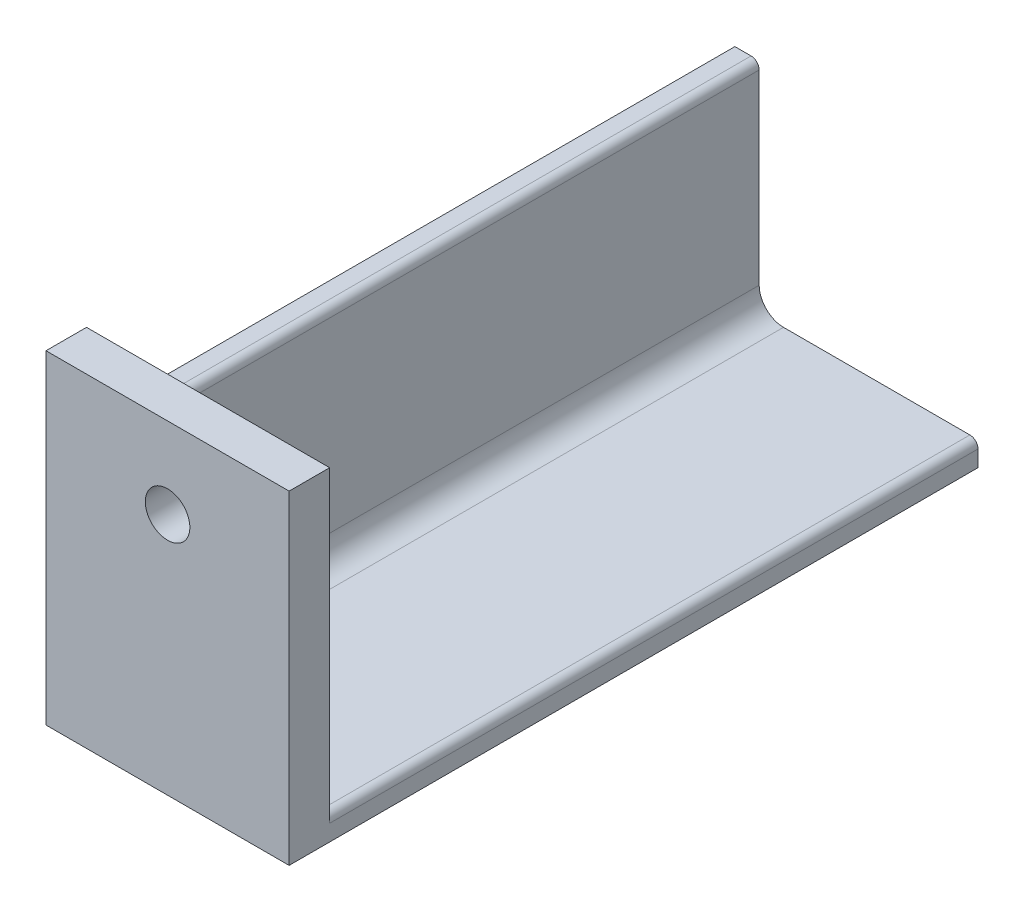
ISO-10303-21;
HEADER;
FILE_DESCRIPTION(('STEP AP214'),'2;1');
FILE_NAME('part.step','',(''),(''),'','','');
FILE_SCHEMA(('AUTOMOTIVE_DESIGN { 1 0 10303 214 1 1 1 1 }'));
ENDSEC;
DATA;
#1=APPLICATION_CONTEXT('core data for automotive mechanical design processes');
#2=APPLICATION_PROTOCOL_DEFINITION('international standard','automotive_design',2000,#1);
#3=PRODUCT_CONTEXT('',#1,'mechanical');
#4=PRODUCT('Part','Part','',(#3));
#5=PRODUCT_RELATED_PRODUCT_CATEGORY('part','',(#4));
#6=PRODUCT_DEFINITION_FORMATION('','',#4);
#7=PRODUCT_DEFINITION_CONTEXT('part definition',#1,'design');
#8=PRODUCT_DEFINITION('design','',#6,#7);
#9=PRODUCT_DEFINITION_SHAPE('','',#8);
#10=(LENGTH_UNIT() NAMED_UNIT(*) SI_UNIT(.MILLI.,.METRE.));
#11=(NAMED_UNIT(*) PLANE_ANGLE_UNIT() SI_UNIT($,.RADIAN.));
#12=(NAMED_UNIT(*) SI_UNIT($,.STERADIAN.) SOLID_ANGLE_UNIT());
#13=UNCERTAINTY_MEASURE_WITH_UNIT(LENGTH_MEASURE(1.E-05),#10,'distance_accuracy_value','');
#14=(GEOMETRIC_REPRESENTATION_CONTEXT(3) GLOBAL_UNCERTAINTY_ASSIGNED_CONTEXT((#13)) GLOBAL_UNIT_ASSIGNED_CONTEXT((#10,
#11,#12)) REPRESENTATION_CONTEXT('',''));
#15=CARTESIAN_POINT('',(0.,0.,0.));
#16=DIRECTION('',(0.,0.,1.));
#17=DIRECTION('',(1.,0.,0.));
#18=AXIS2_PLACEMENT_3D('',#15,#16,#17);
#19=CARTESIAN_POINT('',(4.00000000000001,60.,160.));
#20=DIRECTION('',(0.,-1.,0.));
#21=DIRECTION('',(0.,0.,-1.));
#22=AXIS2_PLACEMENT_3D('',#19,#20,#21);
#23=PLANE('',#22);
#24=DIRECTION('',(-1.,0.,0.));
#25=VECTOR('',#24,1.);
#26=CARTESIAN_POINT('',(4.00000000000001,60.,0.));
#27=LINE('',#26,#25);
#28=CARTESIAN_POINT('',(4.00000000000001,60.,0.));
#29=VERTEX_POINT('',#28);
#30=CARTESIAN_POINT('',(0.,60.,0.));
#31=VERTEX_POINT('',#30);
#32=EDGE_CURVE('E141',#29,#31,#27,.T.);
#33=ORIENTED_EDGE('',*,*,#32,.T.);
#34=DIRECTION('',(0.,0.,-1.));
#35=VECTOR('',#34,1.);
#36=CARTESIAN_POINT('',(0.,60.,160.));
#37=LINE('',#36,#35);
#38=CARTESIAN_POINT('',(0.,60.,160.));
#39=VERTEX_POINT('',#38);
#40=EDGE_CURVE('E11',#39,#31,#37,.T.);
#41=ORIENTED_EDGE('',*,*,#40,.F.);
#42=DIRECTION('',(-1.,0.,0.));
#43=VECTOR('',#42,1.);
#44=CARTESIAN_POINT('',(4.00000000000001,60.,160.));
#45=LINE('',#44,#43);
#46=CARTESIAN_POINT('',(4.00000000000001,60.,160.));
#47=VERTEX_POINT('',#46);
#48=EDGE_CURVE('E133',#47,#39,#45,.T.);
#49=ORIENTED_EDGE('',*,*,#48,.F.);
#50=DIRECTION('',(0.,0.,-1.));
#51=VECTOR('',#50,1.);
#52=CARTESIAN_POINT('',(4.00000000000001,60.,160.));
#53=LINE('',#52,#51);
#54=EDGE_CURVE('E140',#47,#29,#53,.T.);
#55=ORIENTED_EDGE('',*,*,#54,.T.);
#56=EDGE_LOOP('',(#33,#41,#49,#55));
#57=FACE_BOUND('',#56,.T.);
#58=ADVANCED_FACE('F33',(#57),#23,.F.);
#59=CARTESIAN_POINT('',(0.,60.,160.));
#60=DIRECTION('',(1.,0.,0.));
#61=DIRECTION('',(0.,1.,0.));
#62=AXIS2_PLACEMENT_3D('',#59,#60,#61);
#63=PLANE('',#62);
#64=DIRECTION('',(0.,-1.,0.));
#65=VECTOR('',#64,1.);
#66=CARTESIAN_POINT('',(0.,60.,0.));
#67=LINE('',#66,#65);
#68=CARTESIAN_POINT('',(0.,0.,0.));
#69=VERTEX_POINT('',#68);
#70=EDGE_CURVE('E143',#31,#69,#67,.T.);
#71=ORIENTED_EDGE('',*,*,#70,.T.);
#72=DIRECTION('',(0.,0.,-1.));
#73=VECTOR('',#72,1.);
#74=CARTESIAN_POINT('',(0.,0.,160.));
#75=LINE('',#74,#73);
#76=CARTESIAN_POINT('',(0.,0.,170.));
#77=VERTEX_POINT('',#76);
#78=EDGE_CURVE('E41',#77,#69,#75,.T.);
#79=ORIENTED_EDGE('',*,*,#78,.F.);
#80=DIRECTION('',(0.,-1.,0.));
#81=VECTOR('',#80,1.);
#82=CARTESIAN_POINT('',(0.,0.,170.));
#83=LINE('',#82,#81);
#84=CARTESIAN_POINT('',(0.,80.,170.));
#85=VERTEX_POINT('',#84);
#86=EDGE_CURVE('E200',#85,#77,#83,.T.);
#87=ORIENTED_EDGE('',*,*,#86,.F.);
#88=DIRECTION('',(0.,0.,-1.));
#89=VECTOR('',#88,1.);
#90=CARTESIAN_POINT('',(0.,80.,170.));
#91=LINE('',#90,#89);
#92=CARTESIAN_POINT('',(0.,80.,160.));
#93=VERTEX_POINT('',#92);
#94=EDGE_CURVE('E207',#85,#93,#91,.T.);
#95=ORIENTED_EDGE('',*,*,#94,.T.);
#96=DIRECTION('',(0.,-1.,0.));
#97=VECTOR('',#96,1.);
#98=CARTESIAN_POINT('',(0.,0.,160.));
#99=LINE('',#98,#97);
#100=EDGE_CURVE('E198',#93,#39,#99,.T.);
#101=ORIENTED_EDGE('',*,*,#100,.T.);
#102=ORIENTED_EDGE('',*,*,#40,.T.);
#103=EDGE_LOOP('',(#71,#79,#87,#95,#101,#102));
#104=FACE_BOUND('',#103,.T.);
#105=ADVANCED_FACE('F212',(#104),#63,.F.);
#106=CARTESIAN_POINT('',(0.,0.,160.));
#107=DIRECTION('',(0.,1.,0.));
#108=DIRECTION('',(0.,0.,1.));
#109=AXIS2_PLACEMENT_3D('',#106,#107,#108);
#110=PLANE('',#109);
#111=DIRECTION('',(1.,0.,0.));
#112=VECTOR('',#111,1.);
#113=CARTESIAN_POINT('',(0.,0.,0.));
#114=LINE('',#113,#112);
#115=CARTESIAN_POINT('',(60.,0.,0.));
#116=VERTEX_POINT('',#115);
#117=EDGE_CURVE('E146',#69,#116,#114,.T.);
#118=ORIENTED_EDGE('',*,*,#117,.T.);
#119=DIRECTION('',(0.,0.,-1.));
#120=VECTOR('',#119,1.);
#121=CARTESIAN_POINT('',(60.,0.,160.));
#122=LINE('',#121,#120);
#123=CARTESIAN_POINT('',(60.,0.,170.));
#124=VERTEX_POINT('',#123);
#125=EDGE_CURVE('E164',#124,#116,#122,.T.);
#126=ORIENTED_EDGE('',*,*,#125,.F.);
#127=DIRECTION('',(1.,0.,0.));
#128=VECTOR('',#127,1.);
#129=CARTESIAN_POINT('',(0.,0.,170.));
#130=LINE('',#129,#128);
#131=EDGE_CURVE('E175',#77,#124,#130,.T.);
#132=ORIENTED_EDGE('',*,*,#131,.F.);
#133=ORIENTED_EDGE('',*,*,#78,.T.);
#134=EDGE_LOOP('',(#118,#126,#132,#133));
#135=FACE_BOUND('',#134,.T.);
#136=ADVANCED_FACE('F171',(#135),#110,.F.);
#137=CARTESIAN_POINT('',(60.,0.,160.));
#138=DIRECTION('',(-1.,0.,0.));
#139=DIRECTION('',(0.,0.,1.));
#140=AXIS2_PLACEMENT_3D('',#137,#138,#139);
#141=PLANE('',#140);
#142=DIRECTION('',(0.,1.,0.));
#143=VECTOR('',#142,1.);
#144=CARTESIAN_POINT('',(60.,0.,0.));
#145=LINE('',#144,#143);
#146=CARTESIAN_POINT('',(60.,4.,0.));
#147=VERTEX_POINT('',#146);
#148=EDGE_CURVE('E148',#116,#147,#145,.T.);
#149=ORIENTED_EDGE('',*,*,#148,.T.);
#150=DIRECTION('',(0.,0.,-1.));
#151=VECTOR('',#150,1.);
#152=CARTESIAN_POINT('',(60.,4.,160.));
#153=LINE('',#152,#151);
#154=CARTESIAN_POINT('',(60.,4.,160.));
#155=VERTEX_POINT('',#154);
#156=EDGE_CURVE('E161',#155,#147,#153,.T.);
#157=ORIENTED_EDGE('',*,*,#156,.F.);
#158=DIRECTION('',(0.,1.,0.));
#159=VECTOR('',#158,1.);
#160=CARTESIAN_POINT('',(60.,0.,160.));
#161=LINE('',#160,#159);
#162=CARTESIAN_POINT('',(60.,80.,160.));
#163=VERTEX_POINT('',#162);
#164=EDGE_CURVE('E191',#155,#163,#161,.T.);
#165=ORIENTED_EDGE('',*,*,#164,.T.);
#166=DIRECTION('',(0.,0.,-1.));
#167=VECTOR('',#166,1.);
#168=CARTESIAN_POINT('',(60.,80.,170.));
#169=LINE('',#168,#167);
#170=CARTESIAN_POINT('',(60.,80.,170.));
#171=VERTEX_POINT('',#170);
#172=EDGE_CURVE('E144',#171,#163,#169,.T.);
#173=ORIENTED_EDGE('',*,*,#172,.F.);
#174=DIRECTION('',(0.,1.,0.));
#175=VECTOR('',#174,1.);
#176=CARTESIAN_POINT('',(60.,0.,170.));
#177=LINE('',#176,#175);
#178=EDGE_CURVE('E229',#124,#171,#177,.T.);
#179=ORIENTED_EDGE('',*,*,#178,.F.);
#180=ORIENTED_EDGE('',*,*,#125,.T.);
#181=EDGE_LOOP('',(#149,#157,#165,#173,#179,#180));
#182=FACE_BOUND('',#181,.T.);
#183=ADVANCED_FACE('F185',(#182),#141,.F.);
#184=CARTESIAN_POINT('',(58.,4.,160.));
#185=DIRECTION('',(0.,0.,-1.));
#186=DIRECTION('',(-1.,0.,0.));
#187=AXIS2_PLACEMENT_3D('',#184,#185,#186);
#188=CYLINDRICAL_SURFACE('',#187,2.);
#189=CARTESIAN_POINT('',(58.,4.,0.));
#190=DIRECTION('',(0.,0.,1.));
#191=DIRECTION('',(1.,0.,0.));
#192=AXIS2_PLACEMENT_3D('',#189,#190,#191);
#193=CIRCLE('',#192,2.);
#194=CARTESIAN_POINT('',(58.,6.,0.));
#195=VERTEX_POINT('',#194);
#196=EDGE_CURVE('E150',#147,#195,#193,.T.);
#197=ORIENTED_EDGE('',*,*,#196,.T.);
#198=DIRECTION('',(0.,0.,-1.));
#199=VECTOR('',#198,1.);
#200=CARTESIAN_POINT('',(58.,6.,160.));
#201=LINE('',#200,#199);
#202=CARTESIAN_POINT('',(58.,6.,160.));
#203=VERTEX_POINT('',#202);
#204=EDGE_CURVE('E117',#203,#195,#201,.T.);
#205=ORIENTED_EDGE('',*,*,#204,.F.);
#206=CARTESIAN_POINT('',(58.,4.,160.));
#207=DIRECTION('',(0.,0.,1.));
#208=DIRECTION('',(1.,0.,0.));
#209=AXIS2_PLACEMENT_3D('',#206,#207,#208);
#210=CIRCLE('',#209,2.);
#211=EDGE_CURVE('E131',#155,#203,#210,.T.);
#212=ORIENTED_EDGE('',*,*,#211,.F.);
#213=ORIENTED_EDGE('',*,*,#156,.T.);
#214=EDGE_LOOP('',(#197,#205,#212,#213));
#215=FACE_BOUND('',#214,.T.);
#216=ADVANCED_FACE('F189',(#215),#188,.T.);
#217=CARTESIAN_POINT('',(58.,6.,160.));
#218=DIRECTION('',(0.,-1.,0.));
#219=DIRECTION('',(1.,0.,0.));
#220=AXIS2_PLACEMENT_3D('',#217,#218,#219);
#221=PLANE('',#220);
#222=DIRECTION('',(-1.,0.,0.));
#223=VECTOR('',#222,1.);
#224=CARTESIAN_POINT('',(58.,6.,0.));
#225=LINE('',#224,#223);
#226=CARTESIAN_POINT('',(12.,6.,0.));
#227=VERTEX_POINT('',#226);
#228=EDGE_CURVE('E114',#195,#227,#225,.T.);
#229=ORIENTED_EDGE('',*,*,#228,.T.);
#230=DIRECTION('',(0.,0.,-1.));
#231=VECTOR('',#230,1.);
#232=CARTESIAN_POINT('',(12.,6.,160.));
#233=LINE('',#232,#231);
#234=CARTESIAN_POINT('',(12.,6.,160.));
#235=VERTEX_POINT('',#234);
#236=EDGE_CURVE('E106',#235,#227,#233,.T.);
#237=ORIENTED_EDGE('',*,*,#236,.F.);
#238=DIRECTION('',(-1.,0.,0.));
#239=VECTOR('',#238,1.);
#240=CARTESIAN_POINT('',(58.,6.,160.));
#241=LINE('',#240,#239);
#242=EDGE_CURVE('E111',#203,#235,#241,.T.);
#243=ORIENTED_EDGE('',*,*,#242,.F.);
#244=ORIENTED_EDGE('',*,*,#204,.T.);
#245=EDGE_LOOP('',(#229,#237,#243,#244));
#246=FACE_BOUND('',#245,.T.);
#247=ADVANCED_FACE('F108',(#246),#221,.F.);
#248=CARTESIAN_POINT('',(12.,12.,160.));
#249=DIRECTION('',(0.,0.,-1.));
#250=DIRECTION('',(-1.,0.,0.));
#251=AXIS2_PLACEMENT_3D('',#248,#249,#250);
#252=CYLINDRICAL_SURFACE('',#251,6.);
#253=CARTESIAN_POINT('',(12.,12.,0.));
#254=DIRECTION('',(0.,0.,-1.));
#255=DIRECTION('',(-1.,0.,0.));
#256=AXIS2_PLACEMENT_3D('',#253,#254,#255);
#257=CIRCLE('',#256,6.);
#258=CARTESIAN_POINT('',(6.,12.,0.));
#259=VERTEX_POINT('',#258);
#260=EDGE_CURVE('E153',#227,#259,#257,.T.);
#261=ORIENTED_EDGE('',*,*,#260,.T.);
#262=DIRECTION('',(0.,0.,-1.));
#263=VECTOR('',#262,1.);
#264=CARTESIAN_POINT('',(6.,12.,160.));
#265=LINE('',#264,#263);
#266=CARTESIAN_POINT('',(6.,12.,160.));
#267=VERTEX_POINT('',#266);
#268=EDGE_CURVE('E118',#267,#259,#265,.T.);
#269=ORIENTED_EDGE('',*,*,#268,.F.);
#270=CARTESIAN_POINT('',(12.,12.,160.));
#271=DIRECTION('',(0.,0.,-1.));
#272=DIRECTION('',(-1.,0.,0.));
#273=AXIS2_PLACEMENT_3D('',#270,#271,#272);
#274=CIRCLE('',#273,6.);
#275=EDGE_CURVE('E121',#235,#267,#274,.T.);
#276=ORIENTED_EDGE('',*,*,#275,.F.);
#277=ORIENTED_EDGE('',*,*,#236,.T.);
#278=EDGE_LOOP('',(#261,#269,#276,#277));
#279=FACE_BOUND('',#278,.T.);
#280=ADVANCED_FACE('F122',(#279),#252,.F.);
#281=CARTESIAN_POINT('',(6.,12.,160.));
#282=DIRECTION('',(-1.,0.,0.));
#283=DIRECTION('',(0.,-1.,0.));
#284=AXIS2_PLACEMENT_3D('',#281,#282,#283);
#285=PLANE('',#284);
#286=DIRECTION('',(0.,1.,0.));
#287=VECTOR('',#286,1.);
#288=CARTESIAN_POINT('',(6.,12.,0.));
#289=LINE('',#288,#287);
#290=CARTESIAN_POINT('',(6.00000000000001,58.,0.));
#291=VERTEX_POINT('',#290);
#292=EDGE_CURVE('E80',#259,#291,#289,.T.);
#293=ORIENTED_EDGE('',*,*,#292,.T.);
#294=DIRECTION('',(0.,0.,-1.));
#295=VECTOR('',#294,1.);
#296=CARTESIAN_POINT('',(6.00000000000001,58.,160.));
#297=LINE('',#296,#295);
#298=CARTESIAN_POINT('',(6.00000000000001,58.,160.));
#299=VERTEX_POINT('',#298);
#300=EDGE_CURVE('E49',#299,#291,#297,.T.);
#301=ORIENTED_EDGE('',*,*,#300,.F.);
#302=DIRECTION('',(0.,1.,0.));
#303=VECTOR('',#302,1.);
#304=CARTESIAN_POINT('',(6.,12.,160.));
#305=LINE('',#304,#303);
#306=EDGE_CURVE('E125',#267,#299,#305,.T.);
#307=ORIENTED_EDGE('',*,*,#306,.F.);
#308=ORIENTED_EDGE('',*,*,#268,.T.);
#309=EDGE_LOOP('',(#293,#301,#307,#308));
#310=FACE_BOUND('',#309,.T.);
#311=ADVANCED_FACE('F258',(#310),#285,.F.);
#312=CARTESIAN_POINT('',(4.00000000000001,58.,160.));
#313=DIRECTION('',(0.,0.,-1.));
#314=DIRECTION('',(-1.,0.,0.));
#315=AXIS2_PLACEMENT_3D('',#312,#313,#314);
#316=CYLINDRICAL_SURFACE('',#315,2.);
#317=CARTESIAN_POINT('',(4.00000000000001,58.,0.));
#318=DIRECTION('',(0.,0.,1.));
#319=DIRECTION('',(1.,0.,0.));
#320=AXIS2_PLACEMENT_3D('',#317,#318,#319);
#321=CIRCLE('',#320,2.);
#322=EDGE_CURVE('E86',#291,#29,#321,.T.);
#323=ORIENTED_EDGE('',*,*,#322,.T.);
#324=ORIENTED_EDGE('',*,*,#54,.F.);
#325=CARTESIAN_POINT('',(4.00000000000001,58.,160.));
#326=DIRECTION('',(0.,0.,1.));
#327=DIRECTION('',(1.,0.,0.));
#328=AXIS2_PLACEMENT_3D('',#325,#326,#327);
#329=CIRCLE('',#328,2.);
#330=EDGE_CURVE('E138',#299,#47,#329,.T.);
#331=ORIENTED_EDGE('',*,*,#330,.F.);
#332=ORIENTED_EDGE('',*,*,#300,.T.);
#333=EDGE_LOOP('',(#323,#324,#331,#332));
#334=FACE_BOUND('',#333,.T.);
#335=ADVANCED_FACE('F260',(#334),#316,.T.);
#336=CARTESIAN_POINT('',(58.,4.,0.));
#337=DIRECTION('',(0.,0.,1.));
#338=DIRECTION('',(1.,0.,0.));
#339=AXIS2_PLACEMENT_3D('',#336,#337,#338);
#340=PLANE('',#339);
#341=ORIENTED_EDGE('',*,*,#32,.F.);
#342=ORIENTED_EDGE('',*,*,#322,.F.);
#343=ORIENTED_EDGE('',*,*,#292,.F.);
#344=ORIENTED_EDGE('',*,*,#260,.F.);
#345=ORIENTED_EDGE('',*,*,#228,.F.);
#346=ORIENTED_EDGE('',*,*,#196,.F.);
#347=ORIENTED_EDGE('',*,*,#148,.F.);
#348=ORIENTED_EDGE('',*,*,#117,.F.);
#349=ORIENTED_EDGE('',*,*,#70,.F.);
#350=EDGE_LOOP('',(#341,#342,#343,#344,#345,#346,#347,#348,#349));
#351=FACE_BOUND('',#350,.T.);
#352=ADVANCED_FACE('F182',(#351),#340,.F.);
#353=CARTESIAN_POINT('',(0.,80.,170.));
#354=DIRECTION('',(0.,-1.,0.));
#355=DIRECTION('',(0.,0.,-1.));
#356=AXIS2_PLACEMENT_3D('',#353,#354,#355);
#357=PLANE('',#356);
#358=DIRECTION('',(-1.,0.,0.));
#359=VECTOR('',#358,1.);
#360=CARTESIAN_POINT('',(0.,80.,160.));
#361=LINE('',#360,#359);
#362=EDGE_CURVE('E195',#163,#93,#361,.T.);
#363=ORIENTED_EDGE('',*,*,#362,.T.);
#364=ORIENTED_EDGE('',*,*,#94,.F.);
#365=DIRECTION('',(-1.,0.,0.));
#366=VECTOR('',#365,1.);
#367=CARTESIAN_POINT('',(0.,80.,170.));
#368=LINE('',#367,#366);
#369=EDGE_CURVE('E210',#171,#85,#368,.T.);
#370=ORIENTED_EDGE('',*,*,#369,.F.);
#371=ORIENTED_EDGE('',*,*,#172,.T.);
#372=EDGE_LOOP('',(#363,#364,#370,#371));
#373=FACE_BOUND('',#372,.T.);
#374=ADVANCED_FACE('F217',(#373),#357,.F.);
#375=CARTESIAN_POINT('',(0.,0.,170.));
#376=DIRECTION('',(0.,0.,-1.));
#377=DIRECTION('',(-1.,0.,0.));
#378=AXIS2_PLACEMENT_3D('',#375,#376,#377);
#379=PLANE('',#378);
#380=CARTESIAN_POINT('',(30.,60.,170.));
#381=DIRECTION('',(0.,0.,-1.));
#382=DIRECTION('',(-1.,0.,0.));
#383=AXIS2_PLACEMENT_3D('',#380,#381,#382);
#384=CIRCLE('',#383,5.5);
#385=CARTESIAN_POINT('',(24.5,60.,170.));
#386=VERTEX_POINT('',#385);
#387=EDGE_CURVE('E203',#386,#386,#384,.T.);
#388=ORIENTED_EDGE('',*,*,#387,.T.);
#389=EDGE_LOOP('',(#388));
#390=FACE_BOUND('',#389,.T.);
#391=ORIENTED_EDGE('',*,*,#86,.T.);
#392=ORIENTED_EDGE('',*,*,#131,.T.);
#393=ORIENTED_EDGE('',*,*,#178,.T.);
#394=ORIENTED_EDGE('',*,*,#369,.T.);
#395=EDGE_LOOP('',(#391,#392,#393,#394));
#396=FACE_BOUND('',#395,.T.);
#397=ADVANCED_FACE('F228',(#390,#396),#379,.F.);
#398=CARTESIAN_POINT('',(0.,0.,160.));
#399=DIRECTION('',(0.,0.,-1.));
#400=DIRECTION('',(-1.,0.,0.));
#401=AXIS2_PLACEMENT_3D('',#398,#399,#400);
#402=PLANE('',#401);
#403=CARTESIAN_POINT('',(30.,60.,160.));
#404=DIRECTION('',(0.,0.,-1.));
#405=DIRECTION('',(-1.,0.,0.));
#406=AXIS2_PLACEMENT_3D('',#403,#404,#405);
#407=CIRCLE('',#406,5.5);
#408=CARTESIAN_POINT('',(24.5,60.,160.));
#409=VERTEX_POINT('',#408);
#410=EDGE_CURVE('E234',#409,#409,#407,.T.);
#411=ORIENTED_EDGE('',*,*,#410,.F.);
#412=EDGE_LOOP('',(#411));
#413=FACE_BOUND('',#412,.T.);
#414=ORIENTED_EDGE('',*,*,#330,.T.);
#415=ORIENTED_EDGE('',*,*,#48,.T.);
#416=ORIENTED_EDGE('',*,*,#100,.F.);
#417=ORIENTED_EDGE('',*,*,#362,.F.);
#418=ORIENTED_EDGE('',*,*,#164,.F.);
#419=ORIENTED_EDGE('',*,*,#211,.T.);
#420=ORIENTED_EDGE('',*,*,#242,.T.);
#421=ORIENTED_EDGE('',*,*,#275,.T.);
#422=ORIENTED_EDGE('',*,*,#306,.T.);
#423=EDGE_LOOP('',(#414,#415,#416,#417,#418,#419,#420,#421,#422));
#424=FACE_BOUND('',#423,.T.);
#425=ADVANCED_FACE('F128',(#413,#424),#402,.T.);
#426=CARTESIAN_POINT('',(30.,60.,170.));
#427=DIRECTION('',(0.,0.,-1.));
#428=DIRECTION('',(-1.,0.,0.));
#429=AXIS2_PLACEMENT_3D('',#426,#427,#428);
#430=CYLINDRICAL_SURFACE('',#429,5.5);
#431=ORIENTED_EDGE('',*,*,#387,.F.);
#432=EDGE_LOOP('',(#431));
#433=FACE_BOUND('',#432,.T.);
#434=ORIENTED_EDGE('',*,*,#410,.T.);
#435=EDGE_LOOP('',(#434));
#436=FACE_BOUND('',#435,.T.);
#437=ADVANCED_FACE('F241',(#433,#436),#430,.F.);
#438=CLOSED_SHELL('',(#58,#105,#136,#183,#216,#247,#280,#311,#335,#352,#374,#397,#425,#437));
#439=MANIFOLD_SOLID_BREP('B2',#438);
#440=ADVANCED_BREP_SHAPE_REPRESENTATION('',(#18,#439),#14);
#441=SHAPE_DEFINITION_REPRESENTATION(#9,#440);
ENDSEC;
END-ISO-10303-21;
